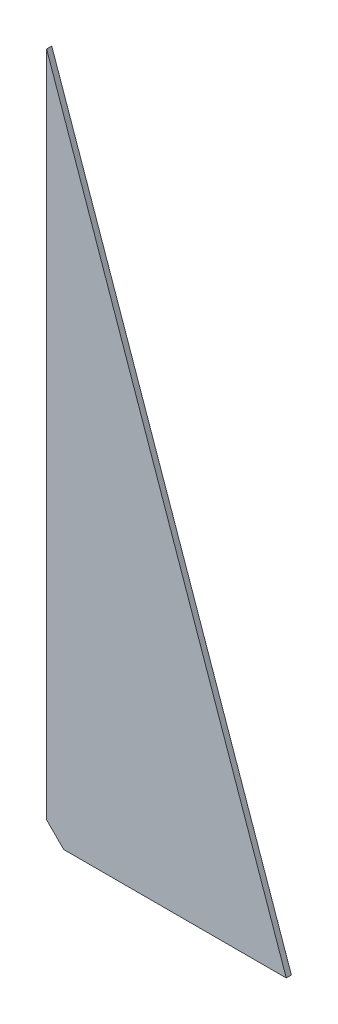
ISO-10303-21;
HEADER;
FILE_DESCRIPTION(('STEP AP214'),'2;1');
FILE_NAME('part.step','',(''),(''),'','','');
FILE_SCHEMA(('AUTOMOTIVE_DESIGN { 1 0 10303 214 1 1 1 1 }'));
ENDSEC;
DATA;
#1=APPLICATION_CONTEXT('core data for automotive mechanical design processes');
#2=APPLICATION_PROTOCOL_DEFINITION('international standard','automotive_design',2000,#1);
#3=PRODUCT_CONTEXT('',#1,'mechanical');
#4=PRODUCT('Part','Part','',(#3));
#5=PRODUCT_RELATED_PRODUCT_CATEGORY('part','',(#4));
#6=PRODUCT_DEFINITION_FORMATION('','',#4);
#7=PRODUCT_DEFINITION_CONTEXT('part definition',#1,'design');
#8=PRODUCT_DEFINITION('design','',#6,#7);
#9=PRODUCT_DEFINITION_SHAPE('','',#8);
#10=(LENGTH_UNIT() NAMED_UNIT(*) SI_UNIT(.MILLI.,.METRE.));
#11=(NAMED_UNIT(*) PLANE_ANGLE_UNIT() SI_UNIT($,.RADIAN.));
#12=(NAMED_UNIT(*) SI_UNIT($,.STERADIAN.) SOLID_ANGLE_UNIT());
#13=UNCERTAINTY_MEASURE_WITH_UNIT(LENGTH_MEASURE(1.E-05),#10,'distance_accuracy_value','');
#14=(GEOMETRIC_REPRESENTATION_CONTEXT(3) GLOBAL_UNCERTAINTY_ASSIGNED_CONTEXT((#13)) GLOBAL_UNIT_ASSIGNED_CONTEXT((#10,
#11,#12)) REPRESENTATION_CONTEXT('',''));
#15=CARTESIAN_POINT('',(0.,0.,0.));
#16=DIRECTION('',(0.,0.,1.));
#17=DIRECTION('',(1.,0.,0.));
#18=AXIS2_PLACEMENT_3D('',#15,#16,#17);
#19=CARTESIAN_POINT('',(0.,200.,1.5));
#20=DIRECTION('',(1.,0.,0.));
#21=DIRECTION('',(0.,1.,0.));
#22=AXIS2_PLACEMENT_3D('',#19,#20,#21);
#23=PLANE('',#22);
#24=DIRECTION('',(0.,-1.,0.));
#25=VECTOR('',#24,1.);
#26=CARTESIAN_POINT('',(0.,200.,0.));
#27=LINE('',#26,#25);
#28=CARTESIAN_POINT('',(0.,200.,0.));
#29=VERTEX_POINT('',#28);
#30=CARTESIAN_POINT('',(0.,5.,0.));
#31=VERTEX_POINT('',#30);
#32=EDGE_CURVE('E90',#29,#31,#27,.T.);
#33=ORIENTED_EDGE('',*,*,#32,.T.);
#34=DIRECTION('',(0.,0.,1.));
#35=VECTOR('',#34,1.);
#36=CARTESIAN_POINT('',(0.,5.,1.5));
#37=LINE('',#36,#35);
#38=CARTESIAN_POINT('',(0.,5.,1.5));
#39=VERTEX_POINT('',#38);
#40=EDGE_CURVE('E46',#31,#39,#37,.T.);
#41=ORIENTED_EDGE('',*,*,#40,.T.);
#42=DIRECTION('',(0.,-1.,0.));
#43=VECTOR('',#42,1.);
#44=CARTESIAN_POINT('',(0.,200.,1.5));
#45=LINE('',#44,#43);
#46=CARTESIAN_POINT('',(0.,200.,1.5));
#47=VERTEX_POINT('',#46);
#48=EDGE_CURVE('E102',#47,#39,#45,.T.);
#49=ORIENTED_EDGE('',*,*,#48,.F.);
#50=DIRECTION('',(0.,0.,-1.));
#51=VECTOR('',#50,1.);
#52=CARTESIAN_POINT('',(0.,200.,1.5));
#53=LINE('',#52,#51);
#54=EDGE_CURVE('E98',#47,#29,#53,.T.);
#55=ORIENTED_EDGE('',*,*,#54,.T.);
#56=EDGE_LOOP('',(#33,#41,#49,#55));
#57=FACE_BOUND('',#56,.T.);
#58=ADVANCED_FACE('F38',(#57),#23,.F.);
#59=CARTESIAN_POINT('',(0.,0.,1.5));
#60=DIRECTION('',(0.,1.,0.));
#61=DIRECTION('',(0.,0.,1.));
#62=AXIS2_PLACEMENT_3D('',#59,#60,#61);
#63=PLANE('',#62);
#64=DIRECTION('',(1.,0.,0.));
#65=VECTOR('',#64,1.);
#66=CARTESIAN_POINT('',(0.,0.,1.5));
#67=LINE('',#66,#65);
#68=CARTESIAN_POINT('',(5.,0.,1.5));
#69=VERTEX_POINT('',#68);
#70=CARTESIAN_POINT('',(70.,0.,1.5));
#71=VERTEX_POINT('',#70);
#72=EDGE_CURVE('E106',#69,#71,#67,.T.);
#73=ORIENTED_EDGE('',*,*,#72,.F.);
#74=DIRECTION('',(0.,0.,-1.));
#75=VECTOR('',#74,1.);
#76=CARTESIAN_POINT('',(5.,0.,1.5));
#77=LINE('',#76,#75);
#78=CARTESIAN_POINT('',(5.,0.,0.));
#79=VERTEX_POINT('',#78);
#80=EDGE_CURVE('E86',#69,#79,#77,.T.);
#81=ORIENTED_EDGE('',*,*,#80,.T.);
#82=DIRECTION('',(1.,0.,0.));
#83=VECTOR('',#82,1.);
#84=CARTESIAN_POINT('',(0.,0.,0.));
#85=LINE('',#84,#83);
#86=CARTESIAN_POINT('',(70.,0.,0.));
#87=VERTEX_POINT('',#86);
#88=EDGE_CURVE('E79',#79,#87,#85,.T.);
#89=ORIENTED_EDGE('',*,*,#88,.T.);
#90=DIRECTION('',(0.,0.,-1.));
#91=VECTOR('',#90,1.);
#92=CARTESIAN_POINT('',(70.,0.,1.5));
#93=LINE('',#92,#91);
#94=EDGE_CURVE('E83',#71,#87,#93,.T.);
#95=ORIENTED_EDGE('',*,*,#94,.F.);
#96=EDGE_LOOP('',(#73,#81,#89,#95));
#97=FACE_BOUND('',#96,.T.);
#98=ADVANCED_FACE('F82',(#97),#63,.F.);
#99=CARTESIAN_POINT('',(70.,0.,1.5));
#100=DIRECTION('',(-0.943858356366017,-0.330350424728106,0.));
#101=DIRECTION('',(0.330350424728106,-0.943858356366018,0.));
#102=AXIS2_PLACEMENT_3D('',#99,#100,#101);
#103=PLANE('',#102);
#104=DIRECTION('',(-0.330350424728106,0.943858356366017,0.));
#105=VECTOR('',#104,1.);
#106=CARTESIAN_POINT('',(70.,0.,0.));
#107=LINE('',#106,#105);
#108=EDGE_CURVE('E89',#87,#29,#107,.T.);
#109=ORIENTED_EDGE('',*,*,#108,.T.);
#110=ORIENTED_EDGE('',*,*,#54,.F.);
#111=DIRECTION('',(-0.330350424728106,0.943858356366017,0.));
#112=VECTOR('',#111,1.);
#113=CARTESIAN_POINT('',(70.,0.,1.5));
#114=LINE('',#113,#112);
#115=EDGE_CURVE('E96',#71,#47,#114,.T.);
#116=ORIENTED_EDGE('',*,*,#115,.F.);
#117=ORIENTED_EDGE('',*,*,#94,.T.);
#118=EDGE_LOOP('',(#109,#110,#116,#117));
#119=FACE_BOUND('',#118,.T.);
#120=ADVANCED_FACE('F93',(#119),#103,.F.);
#121=CARTESIAN_POINT('',(0.,0.,1.5));
#122=DIRECTION('',(0.,0.,1.));
#123=DIRECTION('',(1.,0.,0.));
#124=AXIS2_PLACEMENT_3D('',#121,#122,#123);
#125=PLANE('',#124);
#126=ORIENTED_EDGE('',*,*,#48,.T.);
#127=DIRECTION('',(-0.707106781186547,0.707106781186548,0.));
#128=VECTOR('',#127,1.);
#129=CARTESIAN_POINT('',(2.5,2.5,1.5));
#130=LINE('',#129,#128);
#131=EDGE_CURVE('E11',#39,#69,#130,.F.);
#132=ORIENTED_EDGE('',*,*,#131,.T.);
#133=ORIENTED_EDGE('',*,*,#72,.T.);
#134=ORIENTED_EDGE('',*,*,#115,.T.);
#135=EDGE_LOOP('',(#126,#132,#133,#134));
#136=FACE_BOUND('',#135,.T.);
#137=ADVANCED_FACE('F124',(#136),#125,.T.);
#138=CARTESIAN_POINT('',(0.,0.,0.));
#139=DIRECTION('',(0.,0.,1.));
#140=DIRECTION('',(1.,0.,0.));
#141=AXIS2_PLACEMENT_3D('',#138,#139,#140);
#142=PLANE('',#141);
#143=ORIENTED_EDGE('',*,*,#88,.F.);
#144=DIRECTION('',(0.707106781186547,-0.707106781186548,0.));
#145=VECTOR('',#144,1.);
#146=CARTESIAN_POINT('',(5.,0.,0.));
#147=LINE('',#146,#145);
#148=EDGE_CURVE('E60',#79,#31,#147,.F.);
#149=ORIENTED_EDGE('',*,*,#148,.T.);
#150=ORIENTED_EDGE('',*,*,#32,.F.);
#151=ORIENTED_EDGE('',*,*,#108,.F.);
#152=EDGE_LOOP('',(#143,#149,#150,#151));
#153=FACE_BOUND('',#152,.T.);
#154=ADVANCED_FACE('F100',(#153),#142,.F.);
#155=CARTESIAN_POINT('',(5.,0.,1.5));
#156=DIRECTION('',(0.707106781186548,0.707106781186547,0.));
#157=DIRECTION('',(-0.707106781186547,0.707106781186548,0.));
#158=AXIS2_PLACEMENT_3D('',#155,#156,#157);
#159=PLANE('',#158);
#160=ORIENTED_EDGE('',*,*,#131,.F.);
#161=ORIENTED_EDGE('',*,*,#40,.F.);
#162=ORIENTED_EDGE('',*,*,#148,.F.);
#163=ORIENTED_EDGE('',*,*,#80,.F.);
#164=EDGE_LOOP('',(#160,#161,#162,#163));
#165=FACE_BOUND('',#164,.T.);
#166=ADVANCED_FACE('F122',(#165),#159,.F.);
#167=CLOSED_SHELL('',(#58,#98,#120,#137,#154,#166));
#168=MANIFOLD_SOLID_BREP('B2',#167);
#169=ADVANCED_BREP_SHAPE_REPRESENTATION('',(#18,#168),#14);
#170=SHAPE_DEFINITION_REPRESENTATION(#9,#169);
ENDSEC;
END-ISO-10303-21;
